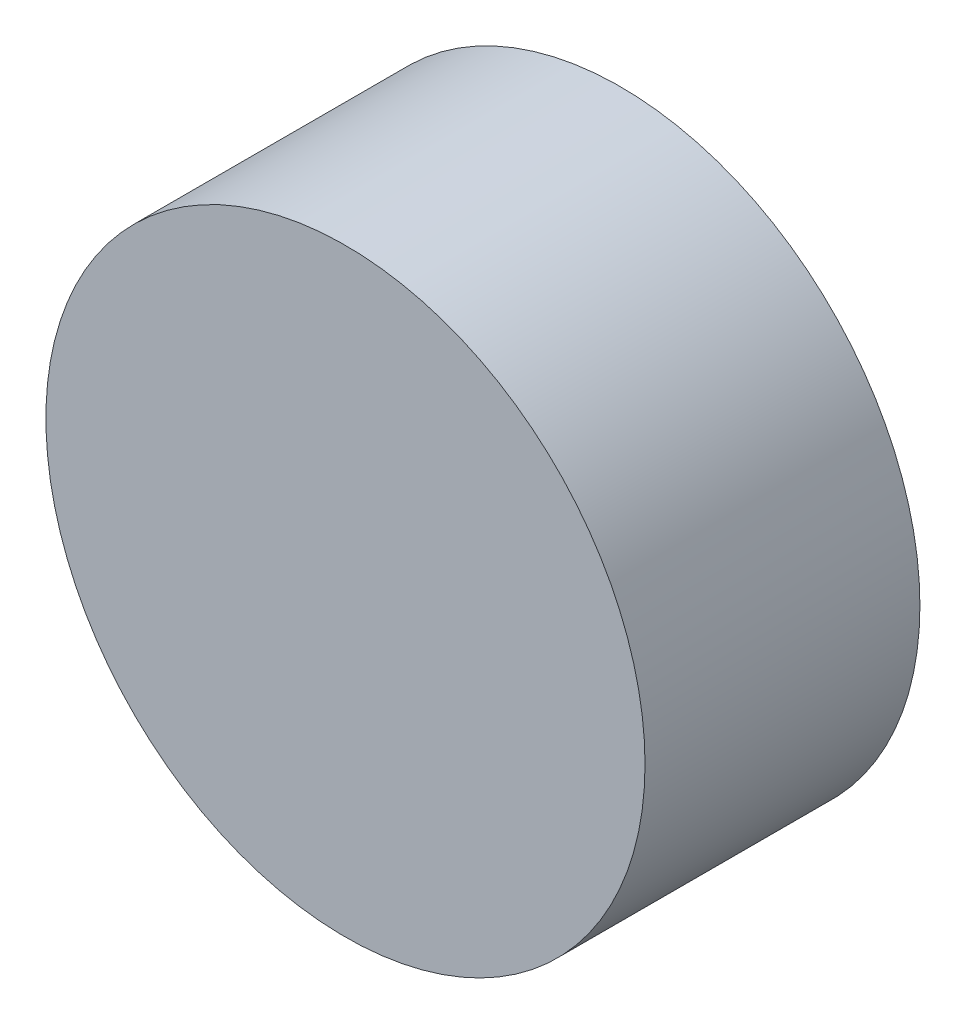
from build123d import *

# Parameters (mm, degrees)
ESQUISSE1_R      = 70
EXTRUSION1_DEPTH = 6
ESQUISSE2_R      = 85
EXTRUSION2_DEPTH = 78


with BuildPart() as part:
    # Esquisse1 → Extrusion1 (new body)
    with BuildSketch(Plane.XY):
        Circle(ESQUISSE1_R)
    extrude(amount=EXTRUSION1_DEPTH)

    # Esquisse2 → Extrusion2 (add)
    with BuildSketch(Plane.XY.offset(6)):
        Circle(ESQUISSE2_R)
    extrude(amount=EXTRUSION2_DEPTH)


solid = part.part
